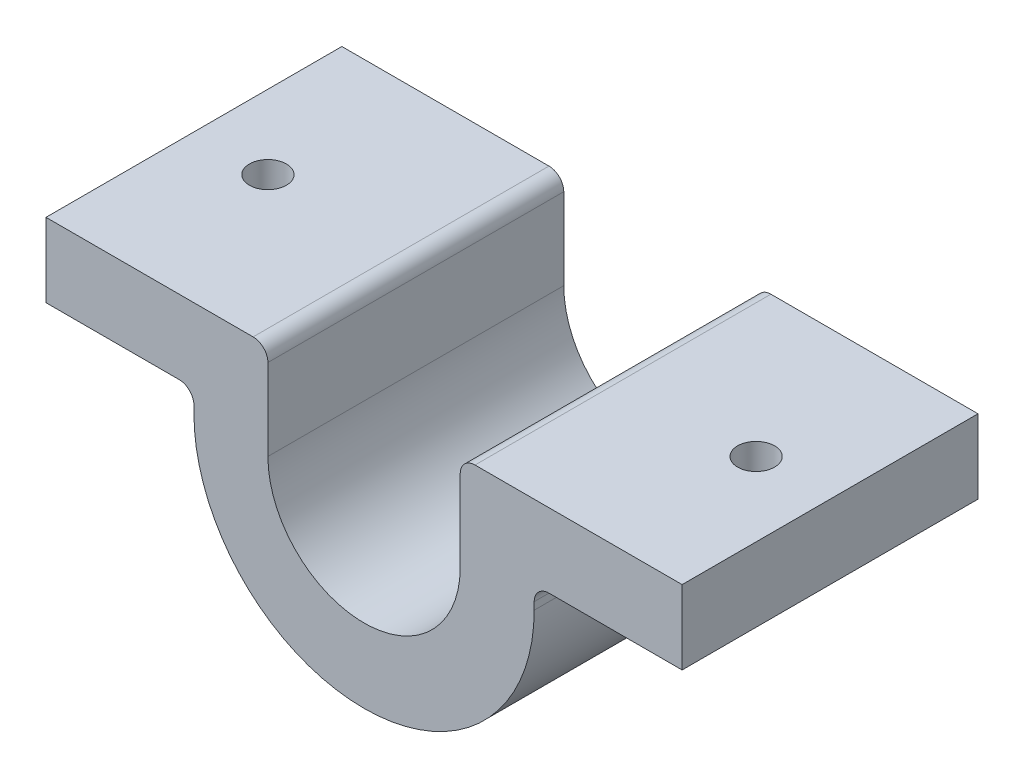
from build123d import *

# Parameters (mm, degrees)
BOSS_EXTRUDE1_DEPTH = 20
SKETCH2_R           = 1.25
CUT_EXTRUDE1_DEPTH  = 20
FILLET1_R           = 1


with BuildPart() as part:
    # Sketch1 → Boss-Extrude1 (new body)
    with BuildSketch(Plane.XY):
        with BuildLine():
            Line((-11.5, 0), (-11.5, 1.5))
            Line((-11.5, 1.5), (-21.5, 1.5))
            Line((-21.5, 1.5), (-21.5, 6.5))
            Line((-21.5, 6.5), (-6.5, 6.5))
            Line((-6.5, 6.5), (-6.5, 0))
            ThreePointArc((-6.5, 0), (0, -6.5), (6.5, 0))
            Line((6.5, 0), (6.5, 6.5))
            Line((6.5, 6.5), (21.5, 6.5))
            Line((21.5, 6.5), (21.5, 1.5))
            Line((21.5, 1.5), (11.5, 1.5))
            Line((11.5, 1.5), (11.5, 0))
            ThreePointArc((11.5, 0), (0, -11.5), (-11.5, 0))
        make_face()
    extrude(amount=-BOSS_EXTRUDE1_DEPTH)

    # Sketch2 → Cut-Extrude1 (cut)
    with BuildSketch(Plane(origin=(0, 1.5, 0), x_dir=(-1, 0, 0), z_dir=(0, -1, 0))):
        with Locations(Location((16.5, 10, 0), (0, 0, 180))):
            Circle(SKETCH2_R)
        with Locations(Location((-16.5, 10, 0), (0, 0, 180))):
            Circle(SKETCH2_R)
    extrude(amount=-CUT_EXTRUDE1_DEPTH, mode=Mode.SUBTRACT)

    # Fillet1
    fillet1_edges = [part.edges().sort_by_distance(p)[0] for p in [
        (-11.5, 1.5, -10),
        (-6.5, 6.5, -10),
        (6.5, 6.5, -10),
        (11.5, 1.5, -10),
    ]]
    fillet(fillet1_edges, radius=FILLET1_R)


solid = part.part
